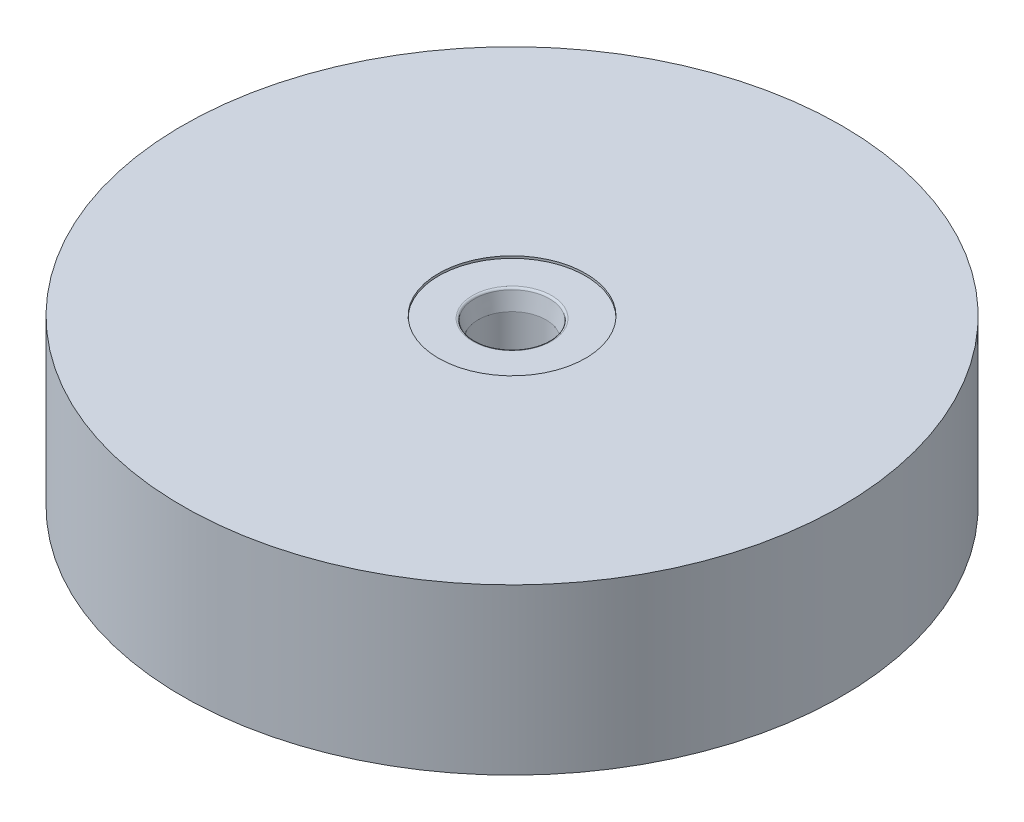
from build123d import *

# Parameters (mm, degrees)
SKETCH2_W           = 38.1
SKETCH2_H           = 19.05
SKETCH22_R          = 10.668
SKETCH22_R_2        = 8.5598
BOSS_EXTRUDE2_DEPTH = 19.05
CHAMFER1_SIZE       = 1.27


with BuildPart() as part:
    # Sketch2 → Revolve1 (revolve)
    with BuildSketch(Plane.XY, mode=Mode.PRIVATE) as revolve1_sk:
        with Locations((-19.05, -9.525)):
            Rectangle(SKETCH2_W, SKETCH2_H)
    revolve(revolve1_sk.sketch.rotate(Axis((0, 0, 0), (0, 1, 0)), 270), axis=Axis((0, 0, 0), (0, 1, 0)))

    # Port Sketch → SAE Port (revolve, cut)
    with BuildSketch(Plane(origin=(1.57790185, 0, 0.931432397), x_dir=(-0.8611569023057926, 0, -0.5083392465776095), z_dir=(-0.5083392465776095, 0, 0.8611569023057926)), mode=Mode.PRIVATE) as sae_port_sk:
        with BuildLine():
            Line((1.832304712, 40.429612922), (5.286704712, 38.354))
            Line((5.286704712, 38.354), (5.286704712, 10.254))
            Line((5.286704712, 10.254), (5.801054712, 10.254))
            Line((5.801054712, 10.254), (5.801054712, 2.308196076))
            Line((5.801054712, 2.308196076), (5.755250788, 2.354))
            Line((5.755250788, 2.354), (6.158855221, 0.455190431))
            ThreePointArc((6.158855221, 0.455190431), (6.247457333, 0.310604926), (6.407304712, 0.254))
            Line((6.407304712, 0.254), (10.332304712, 0.254))
            Line((10.332304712, 0.254), (10.332304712, 0))
            Line((10.332304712, 0), (1.832304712, 0))
            Line((1.832304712, 0), (1.832304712, 40.429612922))
        make_face()
    revolve(sae_port_sk.sketch.rotate(Axis((0, 0, 0), (0, -1, 0)), 239.446729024), axis=Axis((0, 0, 0), (0, -1, 0)), mode=Mode.SUBTRACT)

    # Sketch22 → Boss-Extrude2 (add)
    with BuildSketch(Plane.XZ.offset(19.05)):
        with Locations(Location((0, 0, 0), (0, 0, 90))):
            Circle(SKETCH22_R)
        with Locations(Location((0, 0, 0), (0, 0, 90))):
            Circle(SKETCH22_R_2, mode=Mode.SUBTRACT)
    extrude(amount=BOSS_EXTRUDE2_DEPTH)

    # Chamfer1
    chamfer1_edges = [part.edges().sort_by_distance(p)[0] for p in [
        (0, -38.1, -10.668),
    ]]
    chamfer(chamfer1_edges, length=CHAMFER1_SIZE)


solid = part.part
